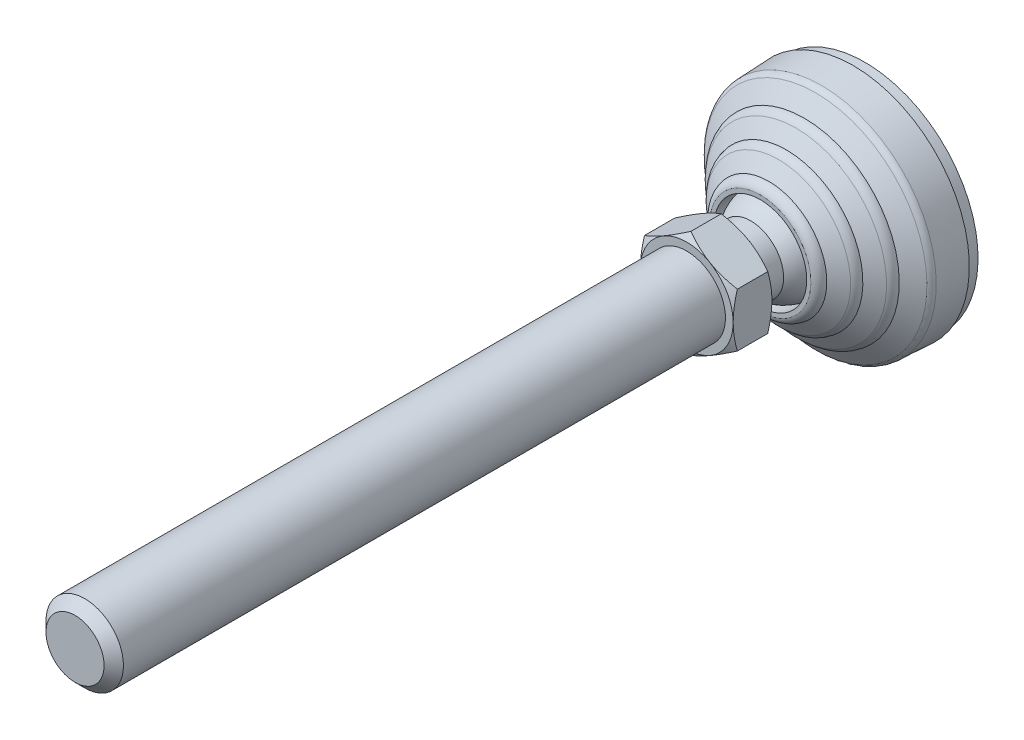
ISO-10303-21;
HEADER;
FILE_DESCRIPTION(('STEP AP214'),'2;1');
FILE_NAME('part.step','',(''),(''),'','','');
FILE_SCHEMA(('AUTOMOTIVE_DESIGN { 1 0 10303 214 1 1 1 1 }'));
ENDSEC;
DATA;
#1=APPLICATION_CONTEXT('core data for automotive mechanical design processes');
#2=APPLICATION_PROTOCOL_DEFINITION('international standard','automotive_design',2000,#1);
#3=PRODUCT_CONTEXT('',#1,'mechanical');
#4=PRODUCT('Part','Part','',(#3));
#5=PRODUCT_RELATED_PRODUCT_CATEGORY('part','',(#4));
#6=PRODUCT_DEFINITION_FORMATION('','',#4);
#7=PRODUCT_DEFINITION_CONTEXT('part definition',#1,'design');
#8=PRODUCT_DEFINITION('design','',#6,#7);
#9=PRODUCT_DEFINITION_SHAPE('','',#8);
#10=(LENGTH_UNIT() NAMED_UNIT(*) SI_UNIT(.MILLI.,.METRE.));
#11=(NAMED_UNIT(*) PLANE_ANGLE_UNIT() SI_UNIT($,.RADIAN.));
#12=(NAMED_UNIT(*) SI_UNIT($,.STERADIAN.) SOLID_ANGLE_UNIT());
#13=UNCERTAINTY_MEASURE_WITH_UNIT(LENGTH_MEASURE(1.E-05),#10,'distance_accuracy_value','');
#14=(GEOMETRIC_REPRESENTATION_CONTEXT(3) GLOBAL_UNCERTAINTY_ASSIGNED_CONTEXT((#13)) GLOBAL_UNIT_ASSIGNED_CONTEXT((#10,
#11,#12)) REPRESENTATION_CONTEXT('',''));
#15=CARTESIAN_POINT('',(0.,0.,0.));
#16=DIRECTION('',(0.,0.,1.));
#17=DIRECTION('',(1.,0.,0.));
#18=AXIS2_PLACEMENT_3D('',#15,#16,#17);
#19=CARTESIAN_POINT('',(0.,0.,93.4665));
#20=DIRECTION('',(0.,0.,-1.));
#21=DIRECTION('',(0.,1.,0.));
#22=AXIS2_PLACEMENT_3D('',#19,#20,#21);
#23=CYLINDRICAL_SURFACE('',#22,10.);
#24=CARTESIAN_POINT('',(0.,0.,201.5));
#25=DIRECTION('',(0.,0.,1.));
#26=DIRECTION('',(0.,-1.,0.));
#27=AXIS2_PLACEMENT_3D('',#24,#25,#26);
#28=CIRCLE('',#27,10.);
#29=CARTESIAN_POINT('',(0.,-10.,201.5));
#30=VERTEX_POINT('',#29);
#31=EDGE_CURVE('E9',#30,#30,#28,.F.);
#32=ORIENTED_EDGE('',*,*,#31,.T.);
#33=EDGE_LOOP('',(#32));
#34=FACE_BOUND('',#33,.T.);
#35=CARTESIAN_POINT('',(0.,0.,46.));
#36=DIRECTION('',(0.,0.,-1.));
#37=DIRECTION('',(0.,1.,0.));
#38=AXIS2_PLACEMENT_3D('',#35,#36,#37);
#39=CIRCLE('',#38,10.);
#40=CARTESIAN_POINT('',(0.,10.,46.));
#41=VERTEX_POINT('',#40);
#42=EDGE_CURVE('E124',#41,#41,#39,.F.);
#43=ORIENTED_EDGE('',*,*,#42,.T.);
#44=EDGE_LOOP('',(#43));
#45=FACE_BOUND('',#44,.T.);
#46=ADVANCED_FACE('F14',(#34,#45),#23,.T.);
#47=CARTESIAN_POINT('',(10.995,0.,46.));
#48=DIRECTION('',(0.,0.,1.));
#49=DIRECTION('',(0.,-1.,0.));
#50=AXIS2_PLACEMENT_3D('',#47,#48,#49);
#51=PLANE('',#50);
#52=CARTESIAN_POINT('',(0.,0.,46.));
#53=DIRECTION('',(0.,0.,-1.));
#54=DIRECTION('',(0.,1.,0.));
#55=AXIS2_PLACEMENT_3D('',#52,#53,#54);
#56=CIRCLE('',#55,11.99);
#57=CARTESIAN_POINT('',(0.,11.99,46.));
#58=VERTEX_POINT('',#57);
#59=EDGE_CURVE('E132',#58,#58,#56,.F.);
#60=ORIENTED_EDGE('',*,*,#59,.T.);
#61=EDGE_LOOP('',(#60));
#62=FACE_BOUND('',#61,.T.);
#63=ORIENTED_EDGE('',*,*,#42,.F.);
#64=EDGE_LOOP('',(#63));
#65=FACE_BOUND('',#64,.T.);
#66=ADVANCED_FACE('F157',(#62,#65),#51,.T.);
#67=CARTESIAN_POINT('',(0.,0.,44.9159643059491));
#68=DIRECTION('',(0.,0.,-1.));
#69=DIRECTION('',(0.,1.,0.));
#70=AXIS2_PLACEMENT_3D('',#67,#68,#69);
#71=CONICAL_SURFACE('',#70,13.8676048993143,1.0471975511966);
#72=ORIENTED_EDGE('',*,*,#59,.F.);
#73=EDGE_LOOP('',(#72));
#74=FACE_BOUND('',#73,.T.);
#75=CARTESIAN_POINT('',(-2.88482840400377E-08,-13.8564064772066,44.9224297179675));
#76=CARTESIAN_POINT('',(0.263784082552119,-13.7041106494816,45.010340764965));
#77=CARTESIAN_POINT('',(0.528551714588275,-13.5512469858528,45.0942615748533));
#78=CARTESIAN_POINT('',(1.06021019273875,-13.2442938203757,45.2530155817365));
#79=CARTESIAN_POINT('',(1.32710170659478,-13.0902039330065,45.3278457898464));
#80=CARTESIAN_POINT('',(2.13207647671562,-12.6254515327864,45.537252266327));
#81=CARTESIAN_POINT('',(2.67333741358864,-12.3129543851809,45.6563603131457));
#82=CARTESIAN_POINT('',(3.48330954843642,-11.8453167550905,45.796023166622));
#83=CARTESIAN_POINT('',(3.74960108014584,-11.6915732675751,45.8358073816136));
#84=CARTESIAN_POINT('',(4.28341699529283,-11.3833745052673,45.9025217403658));
#85=CARTESIAN_POINT('',(4.55094140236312,-11.2289192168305,45.9294516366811));
#86=CARTESIAN_POINT('',(5.08643614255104,-10.9197511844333,45.9697675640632));
#87=CARTESIAN_POINT('',(5.35440556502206,-10.7650389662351,45.9831696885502));
#88=CARTESIAN_POINT('',(5.8905925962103,-10.4554712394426,45.996144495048));
#89=CARTESIAN_POINT('',(6.15881019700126,-10.3006157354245,45.9957176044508));
#90=CARTESIAN_POINT('',(6.66023029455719,-10.0111207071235,45.9820002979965));
#91=CARTESIAN_POINT('',(6.89346857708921,-9.87646052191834,45.97038309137));
#92=CARTESIAN_POINT('',(7.35940867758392,-9.60744987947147,45.9369099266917));
#93=CARTESIAN_POINT('',(7.59211045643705,-9.47309944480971,45.9150532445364));
#94=CARTESIAN_POINT('',(8.05685109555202,-9.20478131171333,45.8614821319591));
#95=CARTESIAN_POINT('',(8.28888924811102,-9.07081402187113,45.8297595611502));
#96=CARTESIAN_POINT('',(8.75187776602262,-8.80350747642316,45.7570131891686));
#97=CARTESIAN_POINT('',(8.98282805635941,-8.67016826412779,45.7159887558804));
#98=CARTESIAN_POINT('',(9.68388987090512,-8.26541003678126,45.5779256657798));
#99=CARTESIAN_POINT('',(10.1519713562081,-7.99516306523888,45.4671213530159));
#100=CARTESIAN_POINT('',(11.081155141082,-7.45869855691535,45.2156417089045));
#101=CARTESIAN_POINT('',(11.5422693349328,-7.19247415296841,45.075025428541));
#102=CARTESIAN_POINT('',(11.9999999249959,-6.92820327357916,44.922429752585));
#103=B_SPLINE_CURVE_WITH_KNOTS('',3,(#75,#76,#77,#78,#79,#80,#81,#82,#83,#84,#85,#86,#87,#88,
#89,#90,#91,#92,#93,#94,#95,#96,#97,#98,#99,#100,#101,#102),.UNSPECIFIED.,.F.,.F.,(4,2,2,2,2,2,
2,2,2,2,2,2,2,4),(0.,0.950996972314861,1.90230578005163,3.80897261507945,4.73890631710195,
5.6688579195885,6.59770188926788,7.52651715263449,8.33503482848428,9.14360968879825,
9.95285348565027,10.7621522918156,12.4163368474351,14.0672749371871),.UNSPECIFIED.);
#104=CARTESIAN_POINT('',(-1.44241383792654E-08,-13.8564064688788,44.9224297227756));
#105=VERTEX_POINT('',#104);
#106=CARTESIAN_POINT('',(12.,-6.92820324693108,44.9224297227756));
#107=VERTEX_POINT('',#106);
#108=EDGE_CURVE('E143',#105,#107,#103,.T.);
#109=ORIENTED_EDGE('',*,*,#108,.T.);
#110=CARTESIAN_POINT('',(12.,-6.92820326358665,44.9224297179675));
#111=CARTESIAN_POINT('',(12.,-6.64374493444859,45.0045333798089));
#112=CARTESIAN_POINT('',(12.,-6.35829458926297,45.0831531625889));
#113=CARTESIAN_POINT('',(12.,-5.78524260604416,45.2325348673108));
#114=CARTESIAN_POINT('',(12.,-5.49764024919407,45.3032940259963));
#115=CARTESIAN_POINT('',(12.,-4.63053083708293,45.5026195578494));
#116=CARTESIAN_POINT('',(12.,-4.04782834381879,45.6179071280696));
#117=CARTESIAN_POINT('',(12.,-3.17548925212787,45.7575170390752));
#118=CARTESIAN_POINT('',(12.,-2.88840964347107,45.7982045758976));
#119=CARTESIAN_POINT('',(12.,-2.31290718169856,45.8685767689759));
#120=CARTESIAN_POINT('',(12.,-2.02448443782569,45.8982623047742));
#121=CARTESIAN_POINT('',(12.,-1.44696804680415,45.9459902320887));
#122=CARTESIAN_POINT('',(12.,-1.15787537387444,45.9640443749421));
#123=CARTESIAN_POINT('',(12.,-0.579188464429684,45.9881624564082));
#124=CARTESIAN_POINT('',(12.,-0.289594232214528,45.994226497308));
#125=CARTESIAN_POINT('',(12.,0.289594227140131,45.9942264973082));
#126=CARTESIAN_POINT('',(12.,0.579188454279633,45.9881624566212));
#127=CARTESIAN_POINT('',(12.,1.15787535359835,45.9640443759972));
#128=CARTESIAN_POINT('',(12.,1.44696802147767,45.9459902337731));
#129=CARTESIAN_POINT('',(12.,2.02448440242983,45.8982623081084));
#130=CARTESIAN_POINT('',(12.,2.31290714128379,45.8685767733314));
#131=CARTESIAN_POINT('',(12.,2.88840959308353,45.798204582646));
#132=CARTESIAN_POINT('',(12.,3.17548919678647,45.7575170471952));
#133=CARTESIAN_POINT('',(12.,4.04782827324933,45.6179071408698));
#134=CARTESIAN_POINT('',(12.,4.63053075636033,45.5026195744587));
#135=CARTESIAN_POINT('',(12.,5.49764015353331,45.3032940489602));
#136=CARTESIAN_POINT('',(12.,5.78524250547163,45.2325348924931));
#137=CARTESIAN_POINT('',(12.,6.35829447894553,45.0831531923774));
#138=CARTESIAN_POINT('',(12.,6.64374481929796,45.004533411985));
#139=CARTESIAN_POINT('',(12.,6.92820314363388,44.9224297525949));
#140=B_SPLINE_CURVE_WITH_KNOTS('',3,(#110,#111,#112,#113,#114,#115,#116,#117,#118,#119,#120,
#121,#122,#123,#124,#125,#126,#127,#128,#129,#130,#131,#132,#133,#134,#135,#136,#137,#138,#139),
.UNSPECIFIED.,.F.,.F.,(4,2,2,2,2,2,2,2,2,2,2,2,2,2,4),(0.,0.888148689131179,1.77660860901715,
3.55698615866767,4.42666281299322,5.2962699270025,6.16499708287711,7.03371682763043,
7.90243655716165,8.7711636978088,9.64077079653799,10.5104474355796,12.2908249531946,
13.1792848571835,14.0674335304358),.UNSPECIFIED.);
#141=CARTESIAN_POINT('',(12.0000000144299,6.92820322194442,44.9224297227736));
#142=VERTEX_POINT('',#141);
#143=EDGE_CURVE('E135',#107,#142,#140,.T.);
#144=ORIENTED_EDGE('',*,*,#143,.T.);
#145=CARTESIAN_POINT('',(12.0000000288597,6.92820321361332,44.9224297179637));
#146=CARTESIAN_POINT('',(11.7362159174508,7.08049904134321,45.0103407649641));
#147=CARTESIAN_POINT('',(11.4714482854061,7.23336270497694,45.0942615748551));
#148=CARTESIAN_POINT('',(10.9397898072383,7.54031587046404,45.2530155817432));
#149=CARTESIAN_POINT('',(10.6728982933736,7.69440575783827,45.3278457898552));
#150=CARTESIAN_POINT('',(9.86792352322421,8.15915815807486,45.5372522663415));
#151=CARTESIAN_POINT('',(9.32666258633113,8.47165530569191,45.6563603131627));
#152=CARTESIAN_POINT('',(8.51669045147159,8.93929293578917,45.7960231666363));
#153=CARTESIAN_POINT('',(8.25039891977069,9.0930364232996,45.8358073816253));
#154=CARTESIAN_POINT('',(7.71658300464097,9.40123518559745,45.9025217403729));
#155=CARTESIAN_POINT('',(7.44905859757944,9.55569047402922,45.9294516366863));
#156=CARTESIAN_POINT('',(6.91356385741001,9.86485850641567,45.9697675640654));
#157=CARTESIAN_POINT('',(6.64559443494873,10.0195707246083,45.9831696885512));
#158=CARTESIAN_POINT('',(6.10940740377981,10.3291384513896,45.996144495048));
#159=CARTESIAN_POINT('',(5.84118980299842,10.4839939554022,45.9957176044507));
#160=CARTESIAN_POINT('',(5.33976970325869,10.773488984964,45.9820002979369));
#161=CARTESIAN_POINT('',(5.10653141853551,10.9081491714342,45.970383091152));
#162=CARTESIAN_POINT('',(4.64059131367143,11.1771598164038,45.9369099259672));
#163=CARTESIAN_POINT('',(4.4078895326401,11.3115102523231,45.9150532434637));
#164=CARTESIAN_POINT('',(3.94314888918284,11.5798283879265,45.8614821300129));
#165=CARTESIAN_POINT('',(3.71111073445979,11.7137956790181,45.8297595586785));
#166=CARTESIAN_POINT('',(3.24812221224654,11.9811022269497,45.7570131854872));
#167=CARTESIAN_POINT('',(3.01717191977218,12.1144414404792,45.7159887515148));
#168=CARTESIAN_POINT('',(2.31611009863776,12.5191996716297,45.5779256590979));
#169=CARTESIAN_POINT('',(1.84802860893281,12.7894466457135,45.4671213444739));
#170=CARTESIAN_POINT('',(0.918844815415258,13.3259111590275,45.2156416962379));
#171=CARTESIAN_POINT('',(0.457730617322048,13.5921355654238,45.0750254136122));
#172=CARTESIAN_POINT('',(2.30778996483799E-08,13.856406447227,44.9224297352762));
#173=B_SPLINE_CURVE_WITH_KNOTS('',3,(#145,#146,#147,#148,#149,#150,#151,#152,#153,#154,#155,
#156,#157,#158,#159,#160,#161,#162,#163,#164,#165,#166,#167,#168,#169,#170,#171,#172),
.UNSPECIFIED.,.F.,.F.,(4,2,2,2,2,2,2,2,2,2,2,2,2,4),(0.,0.95099697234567,1.9023057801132,
3.8089726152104,4.73890631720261,5.66885791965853,6.59770188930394,7.52651715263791,
8.33503483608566,9.14360970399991,9.95285350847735,10.7621523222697,12.4163368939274,
14.0672749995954),.UNSPECIFIED.);
#174=CARTESIAN_POINT('',(-1.15389591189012E-08,13.856406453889,44.92242973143));
#175=VERTEX_POINT('',#174);
#176=EDGE_CURVE('E180',#142,#175,#173,.T.);
#177=ORIENTED_EDGE('',*,*,#176,.T.);
#178=CARTESIAN_POINT('',(-2.30779115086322E-08,13.856406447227,44.9224297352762));
#179=CARTESIAN_POINT('',(-0.263784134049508,13.7041106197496,45.0103407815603));
#180=CARTESIAN_POINT('',(-0.528551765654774,13.5512469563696,45.0942615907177));
#181=CARTESIAN_POINT('',(-1.06021024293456,13.2442937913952,45.2530155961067));
#182=CARTESIAN_POINT('',(-1.32710175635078,13.0902039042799,45.3278458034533));
#183=CARTESIAN_POINT('',(-2.13207652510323,12.6254515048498,45.5372522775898));
#184=CARTESIAN_POINT('',(-2.67333746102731,12.3129543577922,45.656360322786));
#185=CARTESIAN_POINT('',(-3.48330959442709,11.8453167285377,45.7960231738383));
#186=CARTESIAN_POINT('',(-3.74960112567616,11.6915732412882,45.8358073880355));
#187=CARTESIAN_POINT('',(-4.28341703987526,11.3833744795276,45.9025217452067));
#188=CARTESIAN_POINT('',(-4.55094144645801,11.2289191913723,45.9294516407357));
#189=CARTESIAN_POINT('',(-5.08643618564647,10.9197511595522,45.9697675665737));
#190=CARTESIAN_POINT('',(-5.35440560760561,10.7650389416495,45.9831696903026));
#191=CARTESIAN_POINT('',(-5.89059263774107,10.4554712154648,45.9961444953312));
#192=CARTESIAN_POINT('',(-6.15881023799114,10.300615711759,45.9957176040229));
#193=CARTESIAN_POINT('',(-6.66023033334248,10.0111206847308,45.9820002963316));
#194=CARTESIAN_POINT('',(-6.89346861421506,9.87646050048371,45.9703830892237));
#195=CARTESIAN_POINT('',(-7.35940871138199,9.60744985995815,45.9369099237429));
#196=CARTESIAN_POINT('',(-7.59211048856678,9.47309942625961,45.9150532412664));
#197=CARTESIAN_POINT('',(-8.05685112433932,9.20478129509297,45.8614821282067));
#198=CARTESIAN_POINT('',(-8.28888927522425,9.0708140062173,45.8297595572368));
#199=CARTESIAN_POINT('',(-8.75187778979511,8.80350746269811,45.7570131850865));
#200=CARTESIAN_POINT('',(-8.98282807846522,8.67016825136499,45.7159887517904));
#201=CARTESIAN_POINT('',(-9.68388988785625,8.26541002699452,45.5779256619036));
#202=CARTESIAN_POINT('',(-10.1519713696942,7.9951630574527,45.4671213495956));
#203=CARTESIAN_POINT('',(-11.0811551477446,7.45869855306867,45.2156417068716));
#204=CARTESIAN_POINT('',(-11.5422693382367,7.19247415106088,45.0750254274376));
#205=CARTESIAN_POINT('',(-11.9999999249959,6.92820327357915,44.922429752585));
#206=B_SPLINE_CURVE_WITH_KNOTS('',3,(#178,#179,#180,#181,#182,#183,#184,#185,#186,#187,#188,
#189,#190,#191,#192,#193,#194,#195,#196,#197,#198,#199,#200,#201,#202,#203,#204,#205),
.UNSPECIFIED.,.F.,.F.,(4,2,2,2,2,2,2,2,2,2,2,2,2,4),(0.,0.9509969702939,1.90230577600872,
3.80897260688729,4.73890630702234,5.6688579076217,6.5977018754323,7.52651713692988,
8.33503480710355,9.14360966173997,9.95285345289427,10.7621522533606,12.4163367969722,
14.0672748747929),.UNSPECIFIED.);
#207=CARTESIAN_POINT('',(-12.,6.92820324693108,44.9224297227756));
#208=VERTEX_POINT('',#207);
#209=EDGE_CURVE('E172',#175,#208,#206,.T.);
#210=ORIENTED_EDGE('',*,*,#209,.T.);
#211=CARTESIAN_POINT('',(-12.,6.92820326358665,44.9224297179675));
#212=CARTESIAN_POINT('',(-12.,6.64374493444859,45.0045333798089));
#213=CARTESIAN_POINT('',(-12.,6.35829458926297,45.0831531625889));
#214=CARTESIAN_POINT('',(-12.,5.78524260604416,45.2325348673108));
#215=CARTESIAN_POINT('',(-12.,5.49764024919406,45.3032940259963));
#216=CARTESIAN_POINT('',(-12.,4.63053083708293,45.5026195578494));
#217=CARTESIAN_POINT('',(-12.,4.04782834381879,45.6179071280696));
#218=CARTESIAN_POINT('',(-12.,3.17548925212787,45.7575170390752));
#219=CARTESIAN_POINT('',(-12.,2.88840964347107,45.7982045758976));
#220=CARTESIAN_POINT('',(-12.,2.31290718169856,45.8685767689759));
#221=CARTESIAN_POINT('',(-12.,2.02448443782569,45.8982623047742));
#222=CARTESIAN_POINT('',(-12.,1.44696804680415,45.9459902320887));
#223=CARTESIAN_POINT('',(-12.,1.15787537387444,45.9640443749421));
#224=CARTESIAN_POINT('',(-12.,0.579188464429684,45.9881624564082));
#225=CARTESIAN_POINT('',(-12.,0.289594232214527,45.994226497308));
#226=CARTESIAN_POINT('',(-12.,-0.289594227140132,45.9942264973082));
#227=CARTESIAN_POINT('',(-12.,-0.579188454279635,45.9881624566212));
#228=CARTESIAN_POINT('',(-12.,-1.15787535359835,45.9640443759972));
#229=CARTESIAN_POINT('',(-12.,-1.44696802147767,45.9459902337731));
#230=CARTESIAN_POINT('',(-12.,-2.02448440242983,45.8982623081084));
#231=CARTESIAN_POINT('',(-12.,-2.31290714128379,45.8685767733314));
#232=CARTESIAN_POINT('',(-12.,-2.88840959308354,45.798204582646));
#233=CARTESIAN_POINT('',(-12.,-3.17548919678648,45.7575170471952));
#234=CARTESIAN_POINT('',(-12.,-4.04782827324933,45.6179071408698));
#235=CARTESIAN_POINT('',(-12.,-4.63053075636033,45.5026195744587));
#236=CARTESIAN_POINT('',(-12.,-5.49764015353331,45.3032940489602));
#237=CARTESIAN_POINT('',(-12.,-5.78524250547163,45.2325348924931));
#238=CARTESIAN_POINT('',(-12.,-6.35829447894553,45.0831531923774));
#239=CARTESIAN_POINT('',(-12.,-6.64374481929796,45.004533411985));
#240=CARTESIAN_POINT('',(-12.,-6.92820314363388,44.9224297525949));
#241=B_SPLINE_CURVE_WITH_KNOTS('',3,(#211,#212,#213,#214,#215,#216,#217,#218,#219,#220,#221,
#222,#223,#224,#225,#226,#227,#228,#229,#230,#231,#232,#233,#234,#235,#236,#237,#238,#239,#240),
.UNSPECIFIED.,.F.,.F.,(4,2,2,2,2,2,2,2,2,2,2,2,2,2,4),(0.,0.888148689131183,1.77660860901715,
3.55698615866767,4.42666281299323,5.2962699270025,6.16499708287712,7.03371682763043,
7.90243655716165,8.7711636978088,9.640770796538,10.5104474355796,12.2908249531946,
13.1792848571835,14.0674335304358),.UNSPECIFIED.);
#242=CARTESIAN_POINT('',(-12.0000000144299,-6.92820322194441,44.9224297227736));
#243=VERTEX_POINT('',#242);
#244=EDGE_CURVE('E350',#208,#243,#241,.T.);
#245=ORIENTED_EDGE('',*,*,#244,.T.);
#246=CARTESIAN_POINT('',(-12.0000000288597,-6.92820321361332,44.9224297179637));
#247=CARTESIAN_POINT('',(-11.7362159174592,-7.08049904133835,45.0103407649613));
#248=CARTESIAN_POINT('',(-11.471448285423,-7.23336270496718,45.0942615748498));
#249=CARTESIAN_POINT('',(-10.9397898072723,-7.54031587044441,45.2530155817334));
#250=CARTESIAN_POINT('',(-10.6728982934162,-7.69440575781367,45.3278457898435));
#251=CARTESIAN_POINT('',(-9.86792352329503,-8.15915815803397,45.5372522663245));
#252=CARTESIAN_POINT('',(-9.3266625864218,-8.47165530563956,45.6563603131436));
#253=CARTESIAN_POINT('',(-8.5166904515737,-8.93929293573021,45.7960231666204));
#254=CARTESIAN_POINT('',(-8.25039891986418,-9.09303642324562,45.8358073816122));
#255=CARTESIAN_POINT('',(-7.71658300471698,-9.40123518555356,45.9025217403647));
#256=CARTESIAN_POINT('',(-7.44905859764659,-9.55569047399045,45.9294516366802));
#257=CARTESIAN_POINT('',(-6.91356385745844,-9.8648585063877,45.9697675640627));
#258=CARTESIAN_POINT('',(-6.64559443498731,-10.019570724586,45.9831696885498));
#259=CARTESIAN_POINT('',(-6.10940740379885,-10.3291384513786,45.996144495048));
#260=CARTESIAN_POINT('',(-5.84118980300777,-10.4839939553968,45.9957176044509));
#261=CARTESIAN_POINT('',(-5.33976970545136,-10.7734889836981,45.9820002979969));
#262=CARTESIAN_POINT('',(-5.10653142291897,-10.9081491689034,45.9703830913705));
#263=CARTESIAN_POINT('',(-4.64059132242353,-11.1771598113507,45.9369099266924));
#264=CARTESIAN_POINT('',(-4.40788954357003,-11.3115102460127,45.9150532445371));
#265=CARTESIAN_POINT('',(-3.94314890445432,-11.5798283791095,45.8614821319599));
#266=CARTESIAN_POINT('',(-3.71111075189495,-11.7137956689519,45.8297595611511));
#267=CARTESIAN_POINT('',(-3.24812223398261,-11.9811022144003,45.7570131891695));
#268=CARTESIAN_POINT('',(-3.01717194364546,-12.1144414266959,45.7159887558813));
#269=CARTESIAN_POINT('',(-2.3161101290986,-12.5191996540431,45.5779256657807));
#270=CARTESIAN_POINT('',(-1.84802864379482,-12.7894466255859,45.4671213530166));
#271=CARTESIAN_POINT('',(-0.918844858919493,-13.3259111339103,45.215641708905));
#272=CARTESIAN_POINT('',(-0.457730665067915,-13.5921355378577,45.0750254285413));
#273=CARTESIAN_POINT('',(-7.50040961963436E-08,-13.8564064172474,44.922429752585));
#274=B_SPLINE_CURVE_WITH_KNOTS('',3,(#246,#247,#248,#249,#250,#251,#252,#253,#254,#255,#256,
#257,#258,#259,#260,#261,#262,#263,#264,#265,#266,#267,#268,#269,#270,#271,#272,#273),
.UNSPECIFIED.,.F.,.F.,(4,2,2,2,2,2,2,2,2,2,2,2,2,4),(0.,0.950996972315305,1.90230578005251,
3.80897261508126,4.73890631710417,5.66885791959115,6.59770188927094,7.52651715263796,
8.33503482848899,9.14360968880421,9.95285348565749,10.7621522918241,12.4163368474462,
14.0672749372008),.UNSPECIFIED.);
#275=EDGE_CURVE('E162',#243,#105,#274,.T.);
#276=ORIENTED_EDGE('',*,*,#275,.T.);
#277=EDGE_LOOP('',(#109,#144,#177,#210,#245,#276));
#278=FACE_BOUND('',#277,.T.);
#279=ADVANCED_FACE('F152',(#74,#278),#71,.T.);
#280=CARTESIAN_POINT('',(0.,-13.856406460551,46.1));
#281=DIRECTION('',(0.5,0.866025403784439,0.));
#282=DIRECTION('',(-0.866025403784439,0.5,0.));
#283=AXIS2_PLACEMENT_3D('',#280,#281,#282);
#284=PLANE('',#283);
#285=DIRECTION('',(0.,0.,1.));
#286=VECTOR('',#285,1.);
#287=CARTESIAN_POINT('',(0.,-13.856406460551,46.1));
#288=LINE('',#287,#286);
#289=CARTESIAN_POINT('',(0.,-13.856406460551,37.0775702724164));
#290=VERTEX_POINT('',#289);
#291=EDGE_CURVE('E376',#290,#105,#288,.T.);
#292=ORIENTED_EDGE('',*,*,#291,.T.);
#293=ORIENTED_EDGE('',*,*,#275,.F.);
#294=DIRECTION('',(0.,0.,1.));
#295=VECTOR('',#294,1.);
#296=CARTESIAN_POINT('',(-12.,-6.9282032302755,46.1));
#297=LINE('',#296,#295);
#298=CARTESIAN_POINT('',(-12.,-6.9282032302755,37.0775702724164));
#299=VERTEX_POINT('',#298);
#300=EDGE_CURVE('E368',#299,#243,#297,.T.);
#301=ORIENTED_EDGE('',*,*,#300,.F.);
#302=CARTESIAN_POINT('',(0.,-13.856406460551,37.0775702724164));
#303=CARTESIAN_POINT('',(-0.263784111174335,-13.7041106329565,36.9896592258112));
#304=CARTESIAN_POINT('',(-0.528551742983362,-13.5512469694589,36.9057384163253));
#305=CARTESIAN_POINT('',(-1.0602102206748,-13.2442938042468,36.7469844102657));
#306=CARTESIAN_POINT('',(-1.32710173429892,-13.0902039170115,36.6721542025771));
#307=CARTESIAN_POINT('',(-2.13207650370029,-12.6254515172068,36.4627477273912));
#308=CARTESIAN_POINT('',(-2.67333744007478,-12.3129543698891,36.3436396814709));
#309=CARTESIAN_POINT('',(-3.48330957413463,-11.8453167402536,36.2039768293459));
#310=CARTESIAN_POINT('',(-3.74960110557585,-11.6915732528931,36.1641926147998));
#311=CARTESIAN_POINT('',(-4.28341702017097,-11.3833744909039,36.097478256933));
#312=CARTESIAN_POINT('',(-4.55094142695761,-11.2289192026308,36.0705483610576));
#313=CARTESIAN_POINT('',(-5.08643616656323,-10.9197511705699,36.0302324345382));
#314=CARTESIAN_POINT('',(-5.35440558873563,-10.765038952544,36.0168303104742));
#315=CARTESIAN_POINT('',(-5.89059261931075,-10.4554712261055,36.0038555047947));
#316=CARTESIAN_POINT('',(-6.15881021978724,-10.300615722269,36.0042823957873));
#317=CARTESIAN_POINT('',(-6.66023031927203,-10.0111206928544,36.0179997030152));
#318=CARTESIAN_POINT('',(-6.8934686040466,-9.87646050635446,36.029616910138));
#319=CARTESIAN_POINT('',(-7.35940870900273,-9.6074498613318,36.063090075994));
#320=CARTESIAN_POINT('',(-7.59211049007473,-9.47309942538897,36.0849467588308));
#321=CARTESIAN_POINT('',(-8.05685113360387,-9.20478128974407,36.1385178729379));
#322=CARTESIAN_POINT('',(-8.28888928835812,-9.07081399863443,36.1702404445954));
#323=CARTESIAN_POINT('',(-8.75187781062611,-8.8035074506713,36.2429868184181));
#324=CARTESIAN_POINT('',(-8.98282810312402,-8.67016823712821,36.2840112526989));
#325=CARTESIAN_POINT('',(-9.6838899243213,-8.2654100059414,36.4220743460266));
#326=CARTESIAN_POINT('',(-10.1519714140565,-7.99516303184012,36.5328786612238));
#327=CARTESIAN_POINT('',(-11.0811552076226,-7.45869851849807,36.7843583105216));
#328=CARTESIAN_POINT('',(-11.5422694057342,-7.19247411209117,36.924974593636));
#329=CARTESIAN_POINT('',(-12.,-6.9282032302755,37.0775702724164));
#330=B_SPLINE_CURVE_WITH_KNOTS('',3,(#302,#303,#304,#305,#306,#307,#308,#309,#310,#311,#312,
#313,#314,#315,#316,#317,#318,#319,#320,#321,#322,#323,#324,#325,#326,#327,#328,#329),
.UNSPECIFIED.,.F.,.F.,(4,2,2,2,2,2,2,2,2,2,2,2,2,4),(0.,0.950996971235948,1.90230577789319,
3.80897261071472,4.73890631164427,5.66885791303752,6.59770188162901,7.52651714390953,
8.33503482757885,9.14360969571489,9.9528535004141,10.7621523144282,12.4163368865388,
14.0672749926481),.UNSPECIFIED.);
#331=EDGE_CURVE('E370',#290,#299,#330,.T.);
#332=ORIENTED_EDGE('',*,*,#331,.F.);
#333=EDGE_LOOP('',(#292,#293,#301,#332));
#334=FACE_BOUND('',#333,.T.);
#335=ADVANCED_FACE('F156',(#334),#284,.F.);
#336=CARTESIAN_POINT('',(12.,-6.92820323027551,46.1));
#337=DIRECTION('',(-0.5,0.866025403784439,0.));
#338=DIRECTION('',(-0.866025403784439,-0.5,0.));
#339=AXIS2_PLACEMENT_3D('',#336,#337,#338);
#340=PLANE('',#339);
#341=DIRECTION('',(0.,0.,1.));
#342=VECTOR('',#341,1.);
#343=CARTESIAN_POINT('',(12.,-6.92820323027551,46.1));
#344=LINE('',#343,#342);
#345=CARTESIAN_POINT('',(12.,-6.92820323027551,37.0775702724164));
#346=VERTEX_POINT('',#345);
#347=EDGE_CURVE('E31',#346,#107,#344,.T.);
#348=ORIENTED_EDGE('',*,*,#347,.T.);
#349=ORIENTED_EDGE('',*,*,#108,.F.);
#350=ORIENTED_EDGE('',*,*,#291,.F.);
#351=CARTESIAN_POINT('',(12.,-6.92820323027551,37.0775702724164));
#352=CARTESIAN_POINT('',(11.7362158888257,-7.08049905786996,36.9896592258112));
#353=CARTESIAN_POINT('',(11.4714482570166,-7.2333627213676,36.9057384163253));
#354=CARTESIAN_POINT('',(10.9397897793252,-7.5403158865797,36.7469844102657));
#355=CARTESIAN_POINT('',(10.6728982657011,-7.69440577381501,36.6721542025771));
#356=CARTESIAN_POINT('',(9.86792349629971,-8.15915817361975,36.4627477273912));
#357=CARTESIAN_POINT('',(9.32666255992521,-8.4716553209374,36.3436396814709));
#358=CARTESIAN_POINT('',(8.51669042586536,-8.93929295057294,36.2039768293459));
#359=CARTESIAN_POINT('',(8.25039889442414,-9.09303643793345,36.1641926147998));
#360=CARTESIAN_POINT('',(7.71658297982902,-9.40123519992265,36.097478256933));
#361=CARTESIAN_POINT('',(7.44905857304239,-9.55569048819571,36.0705483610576));
#362=CARTESIAN_POINT('',(6.91356383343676,-9.86485852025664,36.0302324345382));
#363=CARTESIAN_POINT('',(6.64559441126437,-10.0195707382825,36.0168303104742));
#364=CARTESIAN_POINT('',(6.10940738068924,-10.329138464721,36.0038555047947));
#365=CARTESIAN_POINT('',(5.84118978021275,-10.4839939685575,36.0042823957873));
#366=CARTESIAN_POINT('',(5.33976968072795,-10.7734889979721,36.0179997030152));
#367=CARTESIAN_POINT('',(5.10653139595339,-10.9081491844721,36.029616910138));
#368=CARTESIAN_POINT('',(4.64059129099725,-11.1771598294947,36.063090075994));
#369=CARTESIAN_POINT('',(4.40788950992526,-11.3115102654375,36.0849467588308));
#370=CARTESIAN_POINT('',(3.94314886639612,-11.5798284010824,36.1385178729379));
#371=CARTESIAN_POINT('',(3.71111071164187,-11.7137956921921,36.1702404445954));
#372=CARTESIAN_POINT('',(3.24812218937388,-11.9811022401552,36.2429868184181));
#373=CARTESIAN_POINT('',(3.01717189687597,-12.1144414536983,36.2840112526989));
#374=CARTESIAN_POINT('',(2.3161100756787,-12.5191996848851,36.4220743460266));
#375=CARTESIAN_POINT('',(1.84802858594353,-12.7894466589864,36.5328786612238));
#376=CARTESIAN_POINT('',(0.918844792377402,-13.3259111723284,36.7843583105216));
#377=CARTESIAN_POINT('',(0.457730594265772,-13.5921355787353,36.924974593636));
#378=CARTESIAN_POINT('',(0.,-13.856406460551,37.0775702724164));
#379=B_SPLINE_CURVE_WITH_KNOTS('',3,(#351,#352,#353,#354,#355,#356,#357,#358,#359,#360,#361,
#362,#363,#364,#365,#366,#367,#368,#369,#370,#371,#372,#373,#374,#375,#376,#377,#378),
.UNSPECIFIED.,.F.,.F.,(4,2,2,2,2,2,2,2,2,2,2,2,2,4),(0.,0.95099697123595,1.90230577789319,
3.80897261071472,4.73890631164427,5.66885791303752,6.59770188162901,7.52651714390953,
8.33503482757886,9.14360969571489,9.9528535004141,10.7621523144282,12.4163368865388,
14.0672749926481),.UNSPECIFIED.);
#380=EDGE_CURVE('E377',#346,#290,#379,.T.);
#381=ORIENTED_EDGE('',*,*,#380,.F.);
#382=EDGE_LOOP('',(#348,#349,#350,#381));
#383=FACE_BOUND('',#382,.T.);
#384=ADVANCED_FACE('F383',(#383),#340,.F.);
#385=CARTESIAN_POINT('',(-12.,6.92820323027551,46.1));
#386=DIRECTION('',(0.5,-0.866025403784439,0.));
#387=DIRECTION('',(0.866025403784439,0.5,0.));
#388=AXIS2_PLACEMENT_3D('',#385,#386,#387);
#389=PLANE('',#388);
#390=DIRECTION('',(0.,0.,1.));
#391=VECTOR('',#390,1.);
#392=CARTESIAN_POINT('',(-12.,6.92820323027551,46.1));
#393=LINE('',#392,#391);
#394=CARTESIAN_POINT('',(-12.,6.92820323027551,37.0775702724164));
#395=VERTEX_POINT('',#394);
#396=EDGE_CURVE('E369',#395,#208,#393,.T.);
#397=ORIENTED_EDGE('',*,*,#396,.T.);
#398=ORIENTED_EDGE('',*,*,#209,.F.);
#399=DIRECTION('',(0.,0.,1.));
#400=VECTOR('',#399,1.);
#401=CARTESIAN_POINT('',(0.,13.856406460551,46.1));
#402=LINE('',#401,#400);
#403=CARTESIAN_POINT('',(0.,13.856406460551,37.0775702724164));
#404=VERTEX_POINT('',#403);
#405=EDGE_CURVE('E211',#404,#175,#402,.T.);
#406=ORIENTED_EDGE('',*,*,#405,.F.);
#407=CARTESIAN_POINT('',(-12.,6.92820323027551,37.0775702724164));
#408=CARTESIAN_POINT('',(-11.7362158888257,7.08049905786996,36.9896592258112));
#409=CARTESIAN_POINT('',(-11.4714482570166,7.2333627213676,36.9057384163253));
#410=CARTESIAN_POINT('',(-10.9397897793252,7.5403158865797,36.7469844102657));
#411=CARTESIAN_POINT('',(-10.6728982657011,7.69440577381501,36.6721542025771));
#412=CARTESIAN_POINT('',(-9.86792349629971,8.15915817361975,36.4627477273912));
#413=CARTESIAN_POINT('',(-9.32666255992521,8.4716553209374,36.3436396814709));
#414=CARTESIAN_POINT('',(-8.51669042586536,8.93929295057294,36.2039768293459));
#415=CARTESIAN_POINT('',(-8.25039889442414,9.09303643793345,36.1641926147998));
#416=CARTESIAN_POINT('',(-7.71658297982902,9.40123519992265,36.097478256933));
#417=CARTESIAN_POINT('',(-7.44905857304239,9.55569048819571,36.0705483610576));
#418=CARTESIAN_POINT('',(-6.91356383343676,9.86485852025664,36.0302324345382));
#419=CARTESIAN_POINT('',(-6.64559441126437,10.0195707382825,36.0168303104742));
#420=CARTESIAN_POINT('',(-6.10940738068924,10.329138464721,36.0038555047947));
#421=CARTESIAN_POINT('',(-5.84118978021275,10.4839939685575,36.0042823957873));
#422=CARTESIAN_POINT('',(-5.33976968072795,10.7734889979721,36.0179997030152));
#423=CARTESIAN_POINT('',(-5.10653139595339,10.9081491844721,36.029616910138));
#424=CARTESIAN_POINT('',(-4.64059129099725,11.1771598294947,36.063090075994));
#425=CARTESIAN_POINT('',(-4.40788950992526,11.3115102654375,36.0849467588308));
#426=CARTESIAN_POINT('',(-3.94314886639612,11.5798284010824,36.1385178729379));
#427=CARTESIAN_POINT('',(-3.71111071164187,11.7137956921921,36.1702404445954));
#428=CARTESIAN_POINT('',(-3.24812218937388,11.9811022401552,36.2429868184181));
#429=CARTESIAN_POINT('',(-3.01717189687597,12.1144414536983,36.2840112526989));
#430=CARTESIAN_POINT('',(-2.3161100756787,12.5191996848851,36.4220743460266));
#431=CARTESIAN_POINT('',(-1.84802858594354,12.7894466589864,36.5328786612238));
#432=CARTESIAN_POINT('',(-0.918844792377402,13.3259111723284,36.7843583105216));
#433=CARTESIAN_POINT('',(-0.457730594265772,13.5921355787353,36.924974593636));
#434=CARTESIAN_POINT('',(0.,13.856406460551,37.0775702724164));
#435=B_SPLINE_CURVE_WITH_KNOTS('',3,(#407,#408,#409,#410,#411,#412,#413,#414,#415,#416,#417,
#418,#419,#420,#421,#422,#423,#424,#425,#426,#427,#428,#429,#430,#431,#432,#433,#434),
.UNSPECIFIED.,.F.,.F.,(4,2,2,2,2,2,2,2,2,2,2,2,2,4),(0.,0.95099697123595,1.90230577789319,
3.80897261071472,4.73890631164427,5.66885791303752,6.59770188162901,7.52651714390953,
8.33503482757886,9.14360969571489,9.9528535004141,10.7621523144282,12.4163368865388,
14.0672749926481),.UNSPECIFIED.);
#436=EDGE_CURVE('E213',#395,#404,#435,.T.);
#437=ORIENTED_EDGE('',*,*,#436,.F.);
#438=EDGE_LOOP('',(#397,#398,#406,#437));
#439=FACE_BOUND('',#438,.T.);
#440=ADVANCED_FACE('F199',(#439),#389,.F.);
#441=CARTESIAN_POINT('',(-12.,-6.92820323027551,46.1));
#442=DIRECTION('',(1.,0.,0.));
#443=DIRECTION('',(0.,1.,0.));
#444=AXIS2_PLACEMENT_3D('',#441,#442,#443);
#445=PLANE('',#444);
#446=ORIENTED_EDGE('',*,*,#300,.T.);
#447=ORIENTED_EDGE('',*,*,#244,.F.);
#448=ORIENTED_EDGE('',*,*,#396,.F.);
#449=CARTESIAN_POINT('',(-12.,-6.9282032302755,37.0775702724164));
#450=CARTESIAN_POINT('',(-12.,-6.64374490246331,36.9954666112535));
#451=CARTESIAN_POINT('',(-12.,-6.35829455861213,36.9168468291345));
#452=CARTESIAN_POINT('',(-12.,-5.78524257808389,36.7674651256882));
#453=CARTESIAN_POINT('',(-12.,-5.49764022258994,36.6967059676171));
#454=CARTESIAN_POINT('',(-12.,-4.63053081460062,36.4973804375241));
#455=CARTESIAN_POINT('',(-12.,-4.04782832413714,36.3820928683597));
#456=CARTESIAN_POINT('',(-12.,-3.17548923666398,36.2424829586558));
#457=CARTESIAN_POINT('',(-12.,-2.88840962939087,36.2017954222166));
#458=CARTESIAN_POINT('',(-12.,-2.31290717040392,36.1314232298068));
#459=CARTESIAN_POINT('',(-12.,-2.02448442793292,36.1017376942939));
#460=CARTESIAN_POINT('',(-12.,-1.44696803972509,36.0540097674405));
#461=CARTESIAN_POINT('',(-12.,-1.1578753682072,36.035955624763));
#462=CARTESIAN_POINT('',(-12.,-0.579188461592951,36.0118375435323));
#463=CARTESIAN_POINT('',(-12.,-0.289594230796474,36.0057735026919));
#464=CARTESIAN_POINT('',(-12.,0.28959423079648,36.0057735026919));
#465=CARTESIAN_POINT('',(-12.,0.579188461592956,36.0118375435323));
#466=CARTESIAN_POINT('',(-12.,1.15787536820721,36.035955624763));
#467=CARTESIAN_POINT('',(-12.,1.4469680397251,36.0540097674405));
#468=CARTESIAN_POINT('',(-12.,2.02448442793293,36.1017376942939));
#469=CARTESIAN_POINT('',(-12.,2.31290717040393,36.1314232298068));
#470=CARTESIAN_POINT('',(-12.,2.88840962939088,36.2017954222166));
#471=CARTESIAN_POINT('',(-12.,3.17548923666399,36.2424829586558));
#472=CARTESIAN_POINT('',(-12.,4.04782832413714,36.3820928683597));
#473=CARTESIAN_POINT('',(-12.,4.63053081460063,36.4973804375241));
#474=CARTESIAN_POINT('',(-12.,5.49764022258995,36.6967059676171));
#475=CARTESIAN_POINT('',(-12.,5.7852425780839,36.7674651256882));
#476=CARTESIAN_POINT('',(-12.,6.35829455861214,36.9168468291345));
#477=CARTESIAN_POINT('',(-12.,6.64374490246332,36.9954666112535));
#478=CARTESIAN_POINT('',(-12.,6.92820323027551,37.0775702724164));
#479=B_SPLINE_CURVE_WITH_KNOTS('',3,(#449,#450,#451,#452,#453,#454,#455,#456,#457,#458,#459,
#460,#461,#462,#463,#464,#465,#466,#467,#468,#469,#470,#471,#472,#473,#474,#475,#476,#477,#478),
.UNSPECIFIED.,.F.,.F.,(4,2,2,2,2,2,2,2,2,2,2,2,2,2,4),(0.,0.888148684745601,1.77660860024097,
3.55698614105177,4.42666279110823,5.29626990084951,6.16499705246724,7.03371679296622,
7.90243653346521,8.77116368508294,9.64077079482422,10.5104474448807,12.2908249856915,
13.1792849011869,14.0674335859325),.UNSPECIFIED.);
#480=EDGE_CURVE('E362',#299,#395,#479,.T.);
#481=ORIENTED_EDGE('',*,*,#480,.F.);
#482=EDGE_LOOP('',(#446,#447,#448,#481));
#483=FACE_BOUND('',#482,.T.);
#484=ADVANCED_FACE('F356',(#483),#445,.F.);
#485=CARTESIAN_POINT('',(12.,6.92820323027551,46.1));
#486=DIRECTION('',(-1.,0.,0.));
#487=DIRECTION('',(0.,-1.,0.));
#488=AXIS2_PLACEMENT_3D('',#485,#486,#487);
#489=PLANE('',#488);
#490=DIRECTION('',(0.,0.,1.));
#491=VECTOR('',#490,1.);
#492=CARTESIAN_POINT('',(12.,6.92820323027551,46.1));
#493=LINE('',#492,#491);
#494=CARTESIAN_POINT('',(12.,6.9282032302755,37.0775702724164));
#495=VERTEX_POINT('',#494);
#496=EDGE_CURVE('E410',#142,#495,#493,.F.);
#497=ORIENTED_EDGE('',*,*,#496,.F.);
#498=ORIENTED_EDGE('',*,*,#143,.F.);
#499=ORIENTED_EDGE('',*,*,#347,.F.);
#500=CARTESIAN_POINT('',(12.,6.92820323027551,37.0775702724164));
#501=CARTESIAN_POINT('',(12.,6.64374490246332,36.9954666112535));
#502=CARTESIAN_POINT('',(12.,6.35829455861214,36.9168468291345));
#503=CARTESIAN_POINT('',(12.,5.7852425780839,36.7674651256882));
#504=CARTESIAN_POINT('',(12.,5.49764022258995,36.6967059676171));
#505=CARTESIAN_POINT('',(12.,4.63053081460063,36.4973804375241));
#506=CARTESIAN_POINT('',(12.,4.04782832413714,36.3820928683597));
#507=CARTESIAN_POINT('',(12.,3.17548923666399,36.2424829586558));
#508=CARTESIAN_POINT('',(12.,2.88840962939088,36.2017954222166));
#509=CARTESIAN_POINT('',(12.,2.31290717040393,36.1314232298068));
#510=CARTESIAN_POINT('',(12.,2.02448442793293,36.1017376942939));
#511=CARTESIAN_POINT('',(12.,1.4469680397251,36.0540097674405));
#512=CARTESIAN_POINT('',(12.,1.1578753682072,36.035955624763));
#513=CARTESIAN_POINT('',(12.,0.579188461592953,36.0118375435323));
#514=CARTESIAN_POINT('',(12.,0.289594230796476,36.0057735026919));
#515=CARTESIAN_POINT('',(12.,-0.289594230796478,36.0057735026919));
#516=CARTESIAN_POINT('',(12.,-0.579188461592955,36.0118375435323));
#517=CARTESIAN_POINT('',(12.,-1.15787536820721,36.035955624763));
#518=CARTESIAN_POINT('',(12.,-1.4469680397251,36.0540097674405));
#519=CARTESIAN_POINT('',(12.,-2.02448442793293,36.1017376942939));
#520=CARTESIAN_POINT('',(12.,-2.31290717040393,36.1314232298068));
#521=CARTESIAN_POINT('',(12.,-2.88840962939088,36.2017954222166));
#522=CARTESIAN_POINT('',(12.,-3.17548923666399,36.2424829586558));
#523=CARTESIAN_POINT('',(12.,-4.04782832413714,36.3820928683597));
#524=CARTESIAN_POINT('',(12.,-4.63053081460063,36.4973804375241));
#525=CARTESIAN_POINT('',(12.,-5.49764022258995,36.6967059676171));
#526=CARTESIAN_POINT('',(12.,-5.7852425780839,36.7674651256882));
#527=CARTESIAN_POINT('',(12.,-6.35829455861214,36.9168468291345));
#528=CARTESIAN_POINT('',(12.,-6.64374490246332,36.9954666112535));
#529=CARTESIAN_POINT('',(12.,-6.92820323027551,37.0775702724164));
#530=B_SPLINE_CURVE_WITH_KNOTS('',3,(#500,#501,#502,#503,#504,#505,#506,#507,#508,#509,#510,
#511,#512,#513,#514,#515,#516,#517,#518,#519,#520,#521,#522,#523,#524,#525,#526,#527,#528,#529),
.UNSPECIFIED.,.F.,.F.,(4,2,2,2,2,2,2,2,2,2,2,2,2,2,4),(0.,0.888148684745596,1.77660860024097,
3.55698614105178,4.42666279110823,5.29626990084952,6.16499705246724,7.03371679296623,
7.90243653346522,8.77116368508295,9.64077079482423,10.5104474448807,12.2908249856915,
13.1792849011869,14.0674335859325),.UNSPECIFIED.);
#531=EDGE_CURVE('E188',#495,#346,#530,.T.);
#532=ORIENTED_EDGE('',*,*,#531,.F.);
#533=EDGE_LOOP('',(#497,#498,#499,#532));
#534=FACE_BOUND('',#533,.T.);
#535=ADVANCED_FACE('F150',(#534),#489,.F.);
#536=CARTESIAN_POINT('',(0.,13.856406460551,46.1));
#537=DIRECTION('',(-0.5,-0.866025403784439,0.));
#538=DIRECTION('',(0.866025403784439,-0.5,0.));
#539=AXIS2_PLACEMENT_3D('',#536,#537,#538);
#540=PLANE('',#539);
#541=ORIENTED_EDGE('',*,*,#405,.T.);
#542=ORIENTED_EDGE('',*,*,#176,.F.);
#543=ORIENTED_EDGE('',*,*,#496,.T.);
#544=CARTESIAN_POINT('',(0.,13.856406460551,37.0775702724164));
#545=CARTESIAN_POINT('',(0.263784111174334,13.7041106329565,36.9896592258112));
#546=CARTESIAN_POINT('',(0.528551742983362,13.5512469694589,36.9057384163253));
#547=CARTESIAN_POINT('',(1.0602102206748,13.2442938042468,36.7469844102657));
#548=CARTESIAN_POINT('',(1.32710173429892,13.0902039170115,36.6721542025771));
#549=CARTESIAN_POINT('',(2.13207650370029,12.6254515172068,36.4627477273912));
#550=CARTESIAN_POINT('',(2.67333744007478,12.3129543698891,36.3436396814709));
#551=CARTESIAN_POINT('',(3.48330957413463,11.8453167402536,36.2039768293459));
#552=CARTESIAN_POINT('',(3.74960110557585,11.6915732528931,36.1641926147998));
#553=CARTESIAN_POINT('',(4.28341702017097,11.3833744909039,36.097478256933));
#554=CARTESIAN_POINT('',(4.55094142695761,11.2289192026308,36.0705483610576));
#555=CARTESIAN_POINT('',(5.08643616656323,10.9197511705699,36.0302324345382));
#556=CARTESIAN_POINT('',(5.35440558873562,10.765038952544,36.0168303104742));
#557=CARTESIAN_POINT('',(5.89059261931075,10.4554712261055,36.0038555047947));
#558=CARTESIAN_POINT('',(6.15881021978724,10.300615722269,36.0042823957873));
#559=CARTESIAN_POINT('',(6.66023031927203,10.0111206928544,36.0179997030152));
#560=CARTESIAN_POINT('',(6.8934686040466,9.87646050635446,36.029616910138));
#561=CARTESIAN_POINT('',(7.35940870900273,9.6074498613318,36.063090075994));
#562=CARTESIAN_POINT('',(7.59211049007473,9.47309942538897,36.0849467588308));
#563=CARTESIAN_POINT('',(8.05685113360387,9.20478128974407,36.1385178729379));
#564=CARTESIAN_POINT('',(8.28888928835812,9.07081399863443,36.1702404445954));
#565=CARTESIAN_POINT('',(8.75187781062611,8.8035074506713,36.2429868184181));
#566=CARTESIAN_POINT('',(8.98282810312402,8.67016823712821,36.2840112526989));
#567=CARTESIAN_POINT('',(9.6838899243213,8.2654100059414,36.4220743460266));
#568=CARTESIAN_POINT('',(10.1519714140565,7.99516303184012,36.5328786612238));
#569=CARTESIAN_POINT('',(11.0811552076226,7.45869851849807,36.7843583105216));
#570=CARTESIAN_POINT('',(11.5422694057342,7.19247411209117,36.924974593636));
#571=CARTESIAN_POINT('',(12.,6.9282032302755,37.0775702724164));
#572=B_SPLINE_CURVE_WITH_KNOTS('',3,(#544,#545,#546,#547,#548,#549,#550,#551,#552,#553,#554,
#555,#556,#557,#558,#559,#560,#561,#562,#563,#564,#565,#566,#567,#568,#569,#570,#571),
.UNSPECIFIED.,.F.,.F.,(4,2,2,2,2,2,2,2,2,2,2,2,2,4),(0.,0.950996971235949,1.90230577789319,
3.80897261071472,4.73890631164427,5.66885791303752,6.59770188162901,7.52651714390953,
8.33503482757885,9.14360969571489,9.9528535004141,10.7621523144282,12.4163368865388,
14.0672749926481),.UNSPECIFIED.);
#573=EDGE_CURVE('E68',#404,#495,#572,.T.);
#574=ORIENTED_EDGE('',*,*,#573,.F.);
#575=EDGE_LOOP('',(#541,#542,#543,#574));
#576=FACE_BOUND('',#575,.T.);
#577=ADVANCED_FACE('F195',(#576),#540,.F.);
#578=CARTESIAN_POINT('',(0.,0.,37.0840356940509));
#579=DIRECTION('',(0.,0.,1.));
#580=DIRECTION('',(0.,-1.,0.));
#581=AXIS2_PLACEMENT_3D('',#578,#579,#580);
#582=CONICAL_SURFACE('',#581,13.8676048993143,1.0471975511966);
#583=CARTESIAN_POINT('',(0.,0.,36.));
#584=DIRECTION('',(0.,0.,1.));
#585=DIRECTION('',(0.,-1.,0.));
#586=AXIS2_PLACEMENT_3D('',#583,#584,#585);
#587=CIRCLE('',#586,11.99);
#588=CARTESIAN_POINT('',(0.,-11.99,36.));
#589=VERTEX_POINT('',#588);
#590=EDGE_CURVE('E212',#589,#589,#587,.T.);
#591=ORIENTED_EDGE('',*,*,#590,.T.);
#592=EDGE_LOOP('',(#591));
#593=FACE_BOUND('',#592,.T.);
#594=ORIENTED_EDGE('',*,*,#573,.T.);
#595=ORIENTED_EDGE('',*,*,#531,.T.);
#596=ORIENTED_EDGE('',*,*,#380,.T.);
#597=ORIENTED_EDGE('',*,*,#331,.T.);
#598=ORIENTED_EDGE('',*,*,#480,.T.);
#599=ORIENTED_EDGE('',*,*,#436,.T.);
#600=EDGE_LOOP('',(#594,#595,#596,#597,#598,#599));
#601=FACE_BOUND('',#600,.T.);
#602=ADVANCED_FACE('F198',(#593,#601),#582,.T.);
#603=CARTESIAN_POINT('',(10.245,0.,36.));
#604=DIRECTION('',(0.,0.,-1.));
#605=DIRECTION('',(0.,1.,0.));
#606=AXIS2_PLACEMENT_3D('',#603,#604,#605);
#607=PLANE('',#606);
#608=CARTESIAN_POINT('',(0.,0.,36.));
#609=DIRECTION('',(0.,0.,-1.));
#610=DIRECTION('',(0.,1.,0.));
#611=AXIS2_PLACEMENT_3D('',#608,#609,#610);
#612=CIRCLE('',#611,8.5);
#613=CARTESIAN_POINT('',(0.,8.5,36.));
#614=VERTEX_POINT('',#613);
#615=EDGE_CURVE('E221',#614,#614,#612,.F.);
#616=ORIENTED_EDGE('',*,*,#615,.T.);
#617=EDGE_LOOP('',(#616));
#618=FACE_BOUND('',#617,.T.);
#619=ORIENTED_EDGE('',*,*,#590,.F.);
#620=EDGE_LOOP('',(#619));
#621=FACE_BOUND('',#620,.T.);
#622=ADVANCED_FACE('F437',(#618,#621),#607,.T.);
#623=CARTESIAN_POINT('',(0.,0.,32.7352685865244));
#624=DIRECTION('',(0.,0.,-1.));
#625=DIRECTION('',(0.,1.,0.));
#626=AXIS2_PLACEMENT_3D('',#623,#624,#625);
#627=CYLINDRICAL_SURFACE('',#626,8.5);
#628=ORIENTED_EDGE('',*,*,#615,.F.);
#629=EDGE_LOOP('',(#628));
#630=FACE_BOUND('',#629,.T.);
#631=CARTESIAN_POINT('',(0.,0.,29.4705371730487));
#632=DIRECTION('',(0.,0.,-1.));
#633=DIRECTION('',(0.,1.,0.));
#634=AXIS2_PLACEMENT_3D('',#631,#632,#633);
#635=CIRCLE('',#634,8.5);
#636=CARTESIAN_POINT('',(0.,8.5,29.4705371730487));
#637=VERTEX_POINT('',#636);
#638=EDGE_CURVE('E97',#637,#637,#635,.F.);
#639=ORIENTED_EDGE('',*,*,#638,.T.);
#640=EDGE_LOOP('',(#639));
#641=FACE_BOUND('',#640,.T.);
#642=ADVANCED_FACE('F117',(#630,#641),#627,.T.);
#643=CARTESIAN_POINT('',(0.,0.,21.));
#644=DIRECTION('',(1.,0.,0.));
#645=DIRECTION('',(0.,0.,1.));
#646=AXIS2_PLACEMENT_3D('',#643,#644,#645);
#647=SPHERICAL_SURFACE('',#646,12.);
#648=CARTESIAN_POINT('',(0.,0.,21.));
#649=DIRECTION('',(0.,0.,1.));
#650=DIRECTION('',(1.,0.,0.));
#651=AXIS2_PLACEMENT_3D('',#648,#649,#650);
#652=CIRCLE('',#651,12.);
#653=CARTESIAN_POINT('',(0.,12.,21.));
#654=VERTEX_POINT('',#653);
#655=CARTESIAN_POINT('',(-12.,0.,21.));
#656=VERTEX_POINT('',#655);
#657=EDGE_CURVE('E77',#654,#656,#652,.T.);
#658=ORIENTED_EDGE('',*,*,#657,.T.);
#659=CARTESIAN_POINT('',(-12.,0.,21.));
#660=CARTESIAN_POINT('',(-12.0000041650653,-0.196349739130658,21.));
#661=CARTESIAN_POINT('',(-11.9951810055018,-0.392699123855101,21.));
#662=CARTESIAN_POINT('',(-11.9759099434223,-0.784925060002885,21.));
#663=CARTESIAN_POINT('',(-11.9614620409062,-0.980801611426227,21.));
#664=CARTESIAN_POINT('',(-11.9229713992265,-1.37160975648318,21.));
#665=CARTESIAN_POINT('',(-11.8989286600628,-1.5665413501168,21.));
#666=CARTESIAN_POINT('',(-11.841307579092,-1.95499003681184,21.));
#667=CARTESIAN_POINT('',(-11.8077292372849,-2.14850712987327,21.));
#668=CARTESIAN_POINT('',(-11.7311174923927,-2.53366059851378,21.));
#669=CARTESIAN_POINT('',(-11.6880840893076,-2.72529697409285,21.));
#670=CARTESIAN_POINT('',(-11.5926659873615,-3.10622734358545,21.));
#671=CARTESIAN_POINT('',(-11.5402812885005,-3.29552133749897,21.));
#672=CARTESIAN_POINT('',(-11.4262867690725,-3.67131091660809,21.));
#673=CARTESIAN_POINT('',(-11.3646769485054,-3.85780650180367,21.));
#674=CARTESIAN_POINT('',(-11.2323806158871,-4.22754997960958,21.));
#675=CARTESIAN_POINT('',(-11.1616941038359,-4.41079787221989,21.));
#676=CARTESIAN_POINT('',(-11.011414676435,-4.77360450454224,21.));
#677=CARTESIAN_POINT('',(-10.9318217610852,-4.95316324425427,21.));
#678=CARTESIAN_POINT('',(-10.7639212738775,-5.30815899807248,21.));
#679=CARTESIAN_POINT('',(-10.6756137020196,-5.48359601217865,21.));
#680=CARTESIAN_POINT('',(-10.4904966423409,-5.82992567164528,21.));
#681=CARTESIAN_POINT('',(-10.3936871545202,-6.00081831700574,21.));
#682=CARTESIAN_POINT('',(-10.1917994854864,-6.33764754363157,21.));
#683=CARTESIAN_POINT('',(-10.0867213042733,-6.50358412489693,20.9999999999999));
#684=CARTESIAN_POINT('',(-9.8685493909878,-6.83010146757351,20.9999999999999));
#685=CARTESIAN_POINT('',(-9.75545565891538,-6.99068222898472,20.9999999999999));
#686=CARTESIAN_POINT('',(-9.5215250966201,-7.30610107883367,20.9999999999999));
#687=CARTESIAN_POINT('',(-9.40068826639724,-7.4609391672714,20.9999999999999));
#688=CARTESIAN_POINT('',(-9.15156261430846,-7.76449965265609,20.9999999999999));
#689=CARTESIAN_POINT('',(-9.02327379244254,-7.91322204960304,20.9999999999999));
#690=CARTESIAN_POINT('',(-8.75955321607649,-8.20419286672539,20.9999999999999));
#691=CARTESIAN_POINT('',(-8.62412146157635,-8.3464412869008,20.9999999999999));
#692=CARTESIAN_POINT('',(-8.3464412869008,-8.62412146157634,20.9999999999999));
#693=CARTESIAN_POINT('',(-8.2041928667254,-8.75955321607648,20.9999999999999));
#694=CARTESIAN_POINT('',(-7.91322204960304,-9.02327379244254,20.9999999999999));
#695=CARTESIAN_POINT('',(-7.76449965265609,-9.15156261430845,20.9999999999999));
#696=CARTESIAN_POINT('',(-7.4609391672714,-9.40068826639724,20.9999999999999));
#697=CARTESIAN_POINT('',(-7.30610107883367,-9.5215250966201,20.9999999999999));
#698=CARTESIAN_POINT('',(-6.99068222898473,-9.75545565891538,20.9999999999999));
#699=CARTESIAN_POINT('',(-6.83010146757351,-9.8685493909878,20.9999999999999));
#700=CARTESIAN_POINT('',(-6.50358412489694,-10.0867213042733,20.9999999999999));
#701=CARTESIAN_POINT('',(-6.33764754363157,-10.1917994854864,20.9999999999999));
#702=CARTESIAN_POINT('',(-6.00081831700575,-10.3936871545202,20.9999999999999));
#703=CARTESIAN_POINT('',(-5.82992567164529,-10.4904966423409,20.9999999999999));
#704=CARTESIAN_POINT('',(-5.48359601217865,-10.6756137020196,20.9999999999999));
#705=CARTESIAN_POINT('',(-5.30815899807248,-10.7639212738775,20.9999999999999));
#706=CARTESIAN_POINT('',(-4.95316324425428,-10.9318217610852,20.9999999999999));
#707=CARTESIAN_POINT('',(-4.77360450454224,-11.011414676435,20.9999999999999));
#708=CARTESIAN_POINT('',(-4.4107978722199,-11.1616941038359,20.9999999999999));
#709=CARTESIAN_POINT('',(-4.22754997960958,-11.2323806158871,20.9999999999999));
#710=CARTESIAN_POINT('',(-3.85780650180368,-11.3646769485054,20.9999999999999));
#711=CARTESIAN_POINT('',(-3.6713109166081,-11.4262867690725,20.9999999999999));
#712=CARTESIAN_POINT('',(-3.29552133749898,-11.5402812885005,20.9999999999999));
#713=CARTESIAN_POINT('',(-3.10622734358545,-11.5926659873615,20.9999999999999));
#714=CARTESIAN_POINT('',(-2.72529697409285,-11.6880840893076,20.9999999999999));
#715=CARTESIAN_POINT('',(-2.53366059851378,-11.7311174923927,20.9999999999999));
#716=CARTESIAN_POINT('',(-2.14850712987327,-11.8077292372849,20.9999999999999));
#717=CARTESIAN_POINT('',(-1.95499003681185,-11.841307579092,20.9999999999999));
#718=CARTESIAN_POINT('',(-1.5665413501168,-11.8989286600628,20.9999999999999));
#719=CARTESIAN_POINT('',(-1.37160975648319,-11.9229713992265,20.9999999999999));
#720=CARTESIAN_POINT('',(-0.980801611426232,-11.9614620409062,20.9999999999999));
#721=CARTESIAN_POINT('',(-0.78492506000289,-11.9759099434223,20.9999999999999));
#722=CARTESIAN_POINT('',(-0.392699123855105,-11.9951810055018,20.9999999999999));
#723=CARTESIAN_POINT('',(-0.196349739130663,-12.0000041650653,20.9999999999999));
#724=CARTESIAN_POINT('',(0.,-12.,20.9999999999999));
#725=B_SPLINE_CURVE_WITH_KNOTS('',3,(#659,#660,#661,#662,#663,#664,#665,#666,#667,#668,#669,
#670,#671,#672,#673,#674,#675,#676,#677,#678,#679,#680,#681,#682,#683,#684,#685,#686,#687,#688,
#689,#690,#691,#692,#693,#694,#695,#696,#697,#698,#699,#700,#701,#702,#703,#704,#705,#706,#707,
#708,#709,#710,#711,#712,#713,#714,#715,#716,#717,#718,#719,#720,#721,#722,#723,#724),
.UNSPECIFIED.,.F.,.F.,(4,2,2,2,2,2,2,2,2,2,2,2,2,2,2,2,2,2,2,2,2,2,2,2,2,2,2,2,2,2,2,2,4),(0.,
0.588989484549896,1.17797896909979,1.76696845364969,2.35595793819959,2.94494742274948,
3.53393690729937,4.12292639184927,4.71191587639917,5.30090536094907,5.88989484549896,
6.47888433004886,7.06787381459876,7.65686329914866,8.24585278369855,8.83484226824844,
9.42383175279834,10.0128212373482,10.6018107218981,11.190800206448,11.7797896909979,
12.3687791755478,12.9577686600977,13.5467581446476,14.1357476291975,14.7247371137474,
15.3137265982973,15.9027160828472,16.4917055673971,17.080695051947,17.6696845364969,
18.2586740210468,18.8476635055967),.UNSPECIFIED.);
#726=CARTESIAN_POINT('',(0.,-12.,21.));
#727=VERTEX_POINT('',#726);
#728=EDGE_CURVE('E88',#656,#727,#725,.T.);
#729=ORIENTED_EDGE('',*,*,#728,.T.);
#730=CARTESIAN_POINT('',(0.,0.,21.));
#731=DIRECTION('',(0.,0.,-1.));
#732=DIRECTION('',(1.,0.,0.));
#733=AXIS2_PLACEMENT_3D('',#730,#731,#732);
#734=CIRCLE('',#733,12.);
#735=CARTESIAN_POINT('',(12.,0.,21.));
#736=VERTEX_POINT('',#735);
#737=EDGE_CURVE('E83',#727,#736,#734,.F.);
#738=ORIENTED_EDGE('',*,*,#737,.T.);
#739=CARTESIAN_POINT('',(12.,0.,21.));
#740=CARTESIAN_POINT('',(12.0000041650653,0.196349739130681,21.));
#741=CARTESIAN_POINT('',(11.9951810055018,0.392699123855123,21.));
#742=CARTESIAN_POINT('',(11.9759099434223,0.784925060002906,21.));
#743=CARTESIAN_POINT('',(11.9614620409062,0.980801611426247,21.));
#744=CARTESIAN_POINT('',(11.9229713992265,1.3716097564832,21.));
#745=CARTESIAN_POINT('',(11.8989286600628,1.56654135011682,21.));
#746=CARTESIAN_POINT('',(11.841307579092,1.95499003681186,21.));
#747=CARTESIAN_POINT('',(11.8077292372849,2.14850712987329,21.));
#748=CARTESIAN_POINT('',(11.7311174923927,2.53366059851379,21.));
#749=CARTESIAN_POINT('',(11.6880840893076,2.72529697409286,21.));
#750=CARTESIAN_POINT('',(11.5926659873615,3.10622734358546,21.));
#751=CARTESIAN_POINT('',(11.5402812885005,3.29552133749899,21.));
#752=CARTESIAN_POINT('',(11.4262867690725,3.6713109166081,21.));
#753=CARTESIAN_POINT('',(11.3646769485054,3.85780650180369,21.));
#754=CARTESIAN_POINT('',(11.2323806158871,4.22754997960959,21.));
#755=CARTESIAN_POINT('',(11.1616941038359,4.4107978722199,21.));
#756=CARTESIAN_POINT('',(11.011414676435,4.77360450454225,21.));
#757=CARTESIAN_POINT('',(10.9318217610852,4.95316324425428,21.));
#758=CARTESIAN_POINT('',(10.7639212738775,5.30815899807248,21.));
#759=CARTESIAN_POINT('',(10.6756137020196,5.48359601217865,21.));
#760=CARTESIAN_POINT('',(10.4904966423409,5.82992567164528,21.));
#761=CARTESIAN_POINT('',(10.3936871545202,6.00081831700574,21.));
#762=CARTESIAN_POINT('',(10.1917994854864,6.33764754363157,21.));
#763=CARTESIAN_POINT('',(10.0867213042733,6.50358412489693,21.));
#764=CARTESIAN_POINT('',(9.8685493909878,6.83010146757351,21.));
#765=CARTESIAN_POINT('',(9.75545565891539,6.99068222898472,21.));
#766=CARTESIAN_POINT('',(9.5215250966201,7.30610107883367,21.));
#767=CARTESIAN_POINT('',(9.40068826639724,7.4609391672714,21.));
#768=CARTESIAN_POINT('',(9.15156261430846,7.76449965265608,21.));
#769=CARTESIAN_POINT('',(9.02327379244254,7.91322204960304,21.));
#770=CARTESIAN_POINT('',(8.75955321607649,8.20419286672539,21.));
#771=CARTESIAN_POINT('',(8.62412146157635,8.3464412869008,21.));
#772=CARTESIAN_POINT('',(8.34644128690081,8.62412146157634,21.));
#773=CARTESIAN_POINT('',(8.20419286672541,8.75955321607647,21.));
#774=CARTESIAN_POINT('',(7.91322204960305,9.02327379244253,21.));
#775=CARTESIAN_POINT('',(7.7644996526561,9.15156261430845,21.));
#776=CARTESIAN_POINT('',(7.46093916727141,9.40068826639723,21.));
#777=CARTESIAN_POINT('',(7.30610107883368,9.52152509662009,21.));
#778=CARTESIAN_POINT('',(6.99068222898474,9.75545565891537,21.));
#779=CARTESIAN_POINT('',(6.83010146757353,9.86854939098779,21.));
#780=CARTESIAN_POINT('',(6.50358412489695,10.0867213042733,21.));
#781=CARTESIAN_POINT('',(6.33764754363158,10.1917994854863,21.));
#782=CARTESIAN_POINT('',(6.00081831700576,10.3936871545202,21.));
#783=CARTESIAN_POINT('',(5.8299256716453,10.4904966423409,21.));
#784=CARTESIAN_POINT('',(5.48359601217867,10.6756137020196,21.));
#785=CARTESIAN_POINT('',(5.3081589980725,10.7639212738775,21.));
#786=CARTESIAN_POINT('',(4.9531632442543,10.9318217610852,21.));
#787=CARTESIAN_POINT('',(4.77360450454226,11.011414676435,21.));
#788=CARTESIAN_POINT('',(4.41079787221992,11.1616941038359,21.));
#789=CARTESIAN_POINT('',(4.2275499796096,11.2323806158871,21.));
#790=CARTESIAN_POINT('',(3.8578065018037,11.3646769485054,21.));
#791=CARTESIAN_POINT('',(3.67131091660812,11.4262867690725,21.));
#792=CARTESIAN_POINT('',(3.29552133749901,11.5402812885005,21.));
#793=CARTESIAN_POINT('',(3.10622734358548,11.5926659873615,21.));
#794=CARTESIAN_POINT('',(2.72529697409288,11.6880840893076,21.));
#795=CARTESIAN_POINT('',(2.53366059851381,11.7311174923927,21.));
#796=CARTESIAN_POINT('',(2.1485071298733,11.8077292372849,21.));
#797=CARTESIAN_POINT('',(1.95499003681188,11.841307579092,21.));
#798=CARTESIAN_POINT('',(1.56654135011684,11.8989286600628,21.));
#799=CARTESIAN_POINT('',(1.37160975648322,11.9229713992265,21.));
#800=CARTESIAN_POINT('',(0.980801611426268,11.9614620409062,21.));
#801=CARTESIAN_POINT('',(0.784925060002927,11.9759099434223,21.));
#802=CARTESIAN_POINT('',(0.392699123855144,11.9951810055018,21.));
#803=CARTESIAN_POINT('',(0.196349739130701,12.0000041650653,21.));
#804=CARTESIAN_POINT('',(0.,12.,21.));
#805=B_SPLINE_CURVE_WITH_KNOTS('',3,(#739,#740,#741,#742,#743,#744,#745,#746,#747,#748,#749,
#750,#751,#752,#753,#754,#755,#756,#757,#758,#759,#760,#761,#762,#763,#764,#765,#766,#767,#768,
#769,#770,#771,#772,#773,#774,#775,#776,#777,#778,#779,#780,#781,#782,#783,#784,#785,#786,#787,
#788,#789,#790,#791,#792,#793,#794,#795,#796,#797,#798,#799,#800,#801,#802,#803,#804),
.UNSPECIFIED.,.F.,.F.,(4,2,2,2,2,2,2,2,2,2,2,2,2,2,2,2,2,2,2,2,2,2,2,2,2,2,2,2,2,2,2,2,4),(0.,
0.588989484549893,1.17797896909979,1.76696845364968,2.35595793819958,2.94494742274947,
3.53393690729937,4.12292639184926,4.71191587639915,5.30090536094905,5.88989484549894,
6.47888433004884,7.06787381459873,7.65686329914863,8.24585278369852,8.83484226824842,
9.42383175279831,10.0128212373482,10.6018107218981,11.190800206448,11.7797896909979,
12.3687791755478,12.9577686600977,13.5467581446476,14.1357476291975,14.7247371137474,
15.3137265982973,15.9027160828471,16.491705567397,17.0806950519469,17.6696845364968,
18.2586740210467,18.8476635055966),.UNSPECIFIED.);
#806=EDGE_CURVE('E90',#736,#654,#805,.T.);
#807=ORIENTED_EDGE('',*,*,#806,.T.);
#808=EDGE_LOOP('',(#658,#729,#738,#807));
#809=FACE_BOUND('',#808,.T.);
#810=ORIENTED_EDGE('',*,*,#638,.F.);
#811=EDGE_LOOP('',(#810));
#812=FACE_BOUND('',#811,.T.);
#813=ADVANCED_FACE('F95',(#809,#812),#647,.T.);
#814=CARTESIAN_POINT('',(-14.625,0.,0.));
#815=DIRECTION('',(0.,0.,-1.));
#816=DIRECTION('',(0.,1.,0.));
#817=AXIS2_PLACEMENT_3D('',#814,#815,#816);
#818=PLANE('',#817);
#819=CARTESIAN_POINT('',(0.,0.,0.));
#820=DIRECTION('',(0.,0.,1.));
#821=DIRECTION('',(0.,-1.,0.));
#822=AXIS2_PLACEMENT_3D('',#819,#820,#821);
#823=CIRCLE('',#822,29.25);
#824=CARTESIAN_POINT('',(0.,-29.25,0.));
#825=VERTEX_POINT('',#824);
#826=EDGE_CURVE('E92',#825,#825,#823,.F.);
#827=ORIENTED_EDGE('',*,*,#826,.T.);
#828=EDGE_LOOP('',(#827));
#829=FACE_BOUND('',#828,.T.);
#830=ADVANCED_FACE('F116',(#829),#818,.T.);
#831=CARTESIAN_POINT('',(0.,0.,1.5));
#832=DIRECTION('',(0.,0.,1.));
#833=DIRECTION('',(0.,-1.,0.));
#834=AXIS2_PLACEMENT_3D('',#831,#832,#833);
#835=CYLINDRICAL_SURFACE('',#834,29.25);
#836=ORIENTED_EDGE('',*,*,#826,.F.);
#837=EDGE_LOOP('',(#836));
#838=FACE_BOUND('',#837,.T.);
#839=CARTESIAN_POINT('',(0.,0.,3.));
#840=DIRECTION('',(0.,0.,1.));
#841=DIRECTION('',(0.,-1.,0.));
#842=AXIS2_PLACEMENT_3D('',#839,#840,#841);
#843=CIRCLE('',#842,29.25);
#844=CARTESIAN_POINT('',(0.,-29.25,3.));
#845=VERTEX_POINT('',#844);
#846=EDGE_CURVE('E285',#845,#845,#843,.F.);
#847=ORIENTED_EDGE('',*,*,#846,.T.);
#848=EDGE_LOOP('',(#847));
#849=FACE_BOUND('',#848,.T.);
#850=ADVANCED_FACE('F464',(#838,#849),#835,.T.);
#851=CARTESIAN_POINT('',(-29.625,0.,3.));
#852=DIRECTION('',(0.,0.,-1.));
#853=DIRECTION('',(0.,1.,0.));
#854=AXIS2_PLACEMENT_3D('',#851,#852,#853);
#855=PLANE('',#854);
#856=CARTESIAN_POINT('',(0.,0.,3.));
#857=DIRECTION('',(0.,0.,-1.));
#858=DIRECTION('',(0.,1.,0.));
#859=AXIS2_PLACEMENT_3D('',#856,#857,#858);
#860=CIRCLE('',#859,30.);
#861=CARTESIAN_POINT('',(0.,30.,3.));
#862=VERTEX_POINT('',#861);
#863=EDGE_CURVE('E288',#862,#862,#860,.T.);
#864=ORIENTED_EDGE('',*,*,#863,.T.);
#865=EDGE_LOOP('',(#864));
#866=FACE_BOUND('',#865,.T.);
#867=ORIENTED_EDGE('',*,*,#846,.F.);
#868=EDGE_LOOP('',(#867));
#869=FACE_BOUND('',#868,.T.);
#870=ADVANCED_FACE('F472',(#866,#869),#855,.T.);
#871=CARTESIAN_POINT('',(0.,0.,3.00000000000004));
#872=DIRECTION('',(0.,0.,-1.));
#873=DIRECTION('',(0.,1.,0.));
#874=AXIS2_PLACEMENT_3D('',#871,#872,#873);
#875=CONICAL_SURFACE('',#874,30.,0.0459663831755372);
#876=ORIENTED_EDGE('',*,*,#863,.F.);
#877=EDGE_LOOP('',(#876));
#878=FACE_BOUND('',#877,.T.);
#879=CARTESIAN_POINT('',(0.,0.,11.1756615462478));
#880=DIRECTION('',(0.,0.,-1.));
#881=DIRECTION('',(-1.,0.,0.));
#882=AXIS2_PLACEMENT_3D('',#879,#880,#881);
#883=CIRCLE('',#882,29.6239295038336);
#884=CARTESIAN_POINT('',(-29.6239295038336,0.,11.1756615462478));
#885=VERTEX_POINT('',#884);
#886=EDGE_CURVE('E233',#885,#885,#883,.T.);
#887=ORIENTED_EDGE('',*,*,#886,.T.);
#888=EDGE_LOOP('',(#887));
#889=FACE_BOUND('',#888,.T.);
#890=ADVANCED_FACE('F241',(#878,#889),#875,.T.);
#891=CARTESIAN_POINT('',(0.,0.,11.0710969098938));
#892=DIRECTION('',(0.,0.,-1.));
#893=DIRECTION('',(0.,1.,0.));
#894=AXIS2_PLACEMENT_3D('',#891,#892,#893);
#895=TOROIDAL_SURFACE('',#894,27.6268354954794,1.9998295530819);
#896=ORIENTED_EDGE('',*,*,#886,.F.);
#897=EDGE_LOOP('',(#896));
#898=FACE_BOUND('',#897,.T.);
#899=CARTESIAN_POINT('',(0.,0.,12.7183562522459));
#900=DIRECTION('',(0.,0.,-1.));
#901=DIRECTION('',(0.,1.,0.));
#902=AXIS2_PLACEMENT_3D('',#899,#900,#901);
#903=CIRCLE('',#902,28.760790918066);
#904=CARTESIAN_POINT('',(0.,28.760790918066,12.7183562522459));
#905=VERTEX_POINT('',#904);
#906=EDGE_CURVE('E613',#905,#905,#903,.T.);
#907=ORIENTED_EDGE('',*,*,#906,.T.);
#908=EDGE_LOOP('',(#907));
#909=FACE_BOUND('',#908,.T.);
#910=ADVANCED_FACE('F236',(#898,#909),#895,.T.);
#911=CARTESIAN_POINT('',(0.,0.,12.7183562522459));
#912=DIRECTION('',(0.,0.,-1.));
#913=DIRECTION('',(0.,1.,0.));
#914=AXIS2_PLACEMENT_3D('',#911,#912,#913);
#915=CONICAL_SURFACE('',#914,28.760790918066,0.967879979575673);
#916=CARTESIAN_POINT('',(0.,0.,15.6295138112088));
#917=DIRECTION('',(0.,0.,-1.));
#918=DIRECTION('',(-1.,0.,0.));
#919=AXIS2_PLACEMENT_3D('',#916,#917,#918);
#920=CIRCLE('',#919,24.5320799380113);
#921=CARTESIAN_POINT('',(-24.5320799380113,0.,15.6295138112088));
#922=VERTEX_POINT('',#921);
#923=EDGE_CURVE('E257',#922,#922,#920,.T.);
#924=ORIENTED_EDGE('',*,*,#923,.T.);
#925=EDGE_LOOP('',(#924));
#926=FACE_BOUND('',#925,.T.);
#927=ORIENTED_EDGE('',*,*,#906,.F.);
#928=EDGE_LOOP('',(#927));
#929=FACE_BOUND('',#928,.T.);
#930=ADVANCED_FACE('F240',(#926,#929),#915,.T.);
#931=CARTESIAN_POINT('',(0.,0.,15.6193000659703));
#932=DIRECTION('',(0.,0.,-1.));
#933=DIRECTION('',(0.,1.,0.));
#934=AXIS2_PLACEMENT_3D('',#931,#932,#933);
#935=TOROIDAL_SURFACE('',#934,21.9321002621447,2.59999973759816);
#936=CARTESIAN_POINT('',(0.,0.,17.7704000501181));
#937=DIRECTION('',(0.,0.,-1.));
#938=DIRECTION('',(0.,1.,0.));
#939=AXIS2_PLACEMENT_3D('',#936,#937,#938);
#940=CIRCLE('',#939,23.3925000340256);
#941=CARTESIAN_POINT('',(0.,23.3925000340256,17.7704000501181));
#942=VERTEX_POINT('',#941);
#943=EDGE_CURVE('E258',#942,#942,#940,.T.);
#944=ORIENTED_EDGE('',*,*,#943,.T.);
#945=EDGE_LOOP('',(#944));
#946=FACE_BOUND('',#945,.T.);
#947=ORIENTED_EDGE('',*,*,#923,.F.);
#948=EDGE_LOOP('',(#947));
#949=FACE_BOUND('',#948,.T.);
#950=ADVANCED_FACE('F246',(#946,#949),#935,.T.);
#951=CARTESIAN_POINT('',(0.,0.,17.7704000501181));
#952=DIRECTION('',(0.,0.,-1.));
#953=DIRECTION('',(0.,1.,0.));
#954=AXIS2_PLACEMENT_3D('',#951,#952,#953);
#955=CONICAL_SURFACE('',#954,23.3925000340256,0.967871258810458);
#956=ORIENTED_EDGE('',*,*,#943,.F.);
#957=EDGE_LOOP('',(#956));
#958=FACE_BOUND('',#957,.T.);
#959=CARTESIAN_POINT('',(0.,0.,20.266146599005));
#960=DIRECTION('',(0.,0.,-1.));
#961=DIRECTION('',(-1.,0.,0.));
#962=AXIS2_PLACEMENT_3D('',#959,#960,#961);
#963=CIRCLE('',#962,19.7672775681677);
#964=CARTESIAN_POINT('',(-19.7672775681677,0.,20.266146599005));
#965=VERTEX_POINT('',#964);
#966=EDGE_CURVE('E261',#965,#965,#963,.T.);
#967=ORIENTED_EDGE('',*,*,#966,.T.);
#968=EDGE_LOOP('',(#967));
#969=FACE_BOUND('',#968,.T.);
#970=ADVANCED_FACE('F251',(#958,#969),#955,.T.);
#971=CARTESIAN_POINT('',(0.,0.,20.149417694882));
#972=DIRECTION('',(0.,0.,-1.));
#973=DIRECTION('',(0.,1.,0.));
#974=AXIS2_PLACEMENT_3D('',#971,#972,#973);
#975=TOROIDAL_SURFACE('',#974,17.1699621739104,2.59993709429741);
#976=ORIENTED_EDGE('',*,*,#966,.F.);
#977=EDGE_LOOP('',(#976));
#978=FACE_BOUND('',#977,.T.);
#979=CARTESIAN_POINT('',(0.,0.,22.3004110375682));
#980=DIRECTION('',(0.,0.,-1.));
#981=DIRECTION('',(0.,1.,0.));
#982=AXIS2_PLACEMENT_3D('',#979,#980,#981);
#983=CIRCLE('',#982,18.63040749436);
#984=CARTESIAN_POINT('',(0.,18.63040749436,22.3004110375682));
#985=VERTEX_POINT('',#984);
#986=EDGE_CURVE('E601',#985,#985,#983,.T.);
#987=ORIENTED_EDGE('',*,*,#986,.T.);
#988=EDGE_LOOP('',(#987));
#989=FACE_BOUND('',#988,.T.);
#990=ADVANCED_FACE('F265',(#978,#989),#975,.T.);
#991=CARTESIAN_POINT('',(0.,0.,22.3004110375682));
#992=DIRECTION('',(0.,0.,-1.));
#993=DIRECTION('',(0.,1.,0.));
#994=AXIS2_PLACEMENT_3D('',#991,#992,#993);
#995=CONICAL_SURFACE('',#994,18.63040749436,0.967870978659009);
#996=CARTESIAN_POINT('',(0.,0.,24.8062186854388));
#997=DIRECTION('',(0.,0.,-1.));
#998=DIRECTION('',(-1.,0.,0.));
#999=AXIS2_PLACEMENT_3D('',#996,#997,#998);
#1000=CIRCLE('',#999,14.9905728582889);
#1001=CARTESIAN_POINT('',(-14.9905728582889,0.,24.8062186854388));
#1002=VERTEX_POINT('',#1001);
#1003=EDGE_CURVE('E282',#1002,#1002,#1000,.T.);
#1004=ORIENTED_EDGE('',*,*,#1003,.T.);
#1005=EDGE_LOOP('',(#1004));
#1006=FACE_BOUND('',#1005,.T.);
#1007=ORIENTED_EDGE('',*,*,#986,.F.);
#1008=EDGE_LOOP('',(#1007));
#1009=FACE_BOUND('',#1008,.T.);
#1010=ADVANCED_FACE('F268',(#1006,#1009),#995,.T.);
#1011=CARTESIAN_POINT('',(0.,0.,24.5842));
#1012=DIRECTION('',(0.,0.,-1.));
#1013=DIRECTION('',(0.,1.,0.));
#1014=AXIS2_PLACEMENT_3D('',#1011,#1012,#1013);
#1015=TOROIDAL_SURFACE('',#1014,12.5253,2.47525);
#1016=CARTESIAN_POINT('',(0.,0.,27.));
#1017=DIRECTION('',(0.,0.,-1.));
#1018=DIRECTION('',(0.,1.,0.));
#1019=AXIS2_PLACEMENT_3D('',#1016,#1017,#1018);
#1020=CIRCLE('',#1019,13.0645336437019);
#1021=CARTESIAN_POINT('',(0.,13.0645336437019,27.));
#1022=VERTEX_POINT('',#1021);
#1023=EDGE_CURVE('E291',#1022,#1022,#1020,.T.);
#1024=ORIENTED_EDGE('',*,*,#1023,.T.);
#1025=EDGE_LOOP('',(#1024));
#1026=FACE_BOUND('',#1025,.T.);
#1027=ORIENTED_EDGE('',*,*,#1003,.F.);
#1028=EDGE_LOOP('',(#1027));
#1029=FACE_BOUND('',#1028,.T.);
#1030=ADVANCED_FACE('F272',(#1026,#1029),#1015,.T.);
#1031=CARTESIAN_POINT('',(-6.53226682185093,0.,27.));
#1032=DIRECTION('',(0.,0.,1.));
#1033=DIRECTION('',(-1.,0.,0.));
#1034=AXIS2_PLACEMENT_3D('',#1031,#1032,#1033);
#1035=PLANE('',#1034);
#1036=ORIENTED_EDGE('',*,*,#1023,.F.);
#1037=EDGE_LOOP('',(#1036));
#1038=FACE_BOUND('',#1037,.T.);
#1039=CARTESIAN_POINT('',(0.,0.,27.));
#1040=DIRECTION('',(0.,0.,-1.));
#1041=DIRECTION('',(0.,1.,0.));
#1042=AXIS2_PLACEMENT_3D('',#1039,#1040,#1041);
#1043=CIRCLE('',#1042,12.);
#1044=CARTESIAN_POINT('',(0.,12.,27.));
#1045=VERTEX_POINT('',#1044);
#1046=EDGE_CURVE('E294',#1045,#1045,#1043,.T.);
#1047=ORIENTED_EDGE('',*,*,#1046,.T.);
#1048=EDGE_LOOP('',(#1047));
#1049=FACE_BOUND('',#1048,.T.);
#1050=ADVANCED_FACE('F277',(#1038,#1049),#1035,.T.);
#1051=CARTESIAN_POINT('',(0.,0.,33.));
#1052=DIRECTION('',(0.,0.,-1.));
#1053=DIRECTION('',(0.,1.,0.));
#1054=AXIS2_PLACEMENT_3D('',#1051,#1052,#1053);
#1055=CYLINDRICAL_SURFACE('',#1054,12.);
#1056=ORIENTED_EDGE('',*,*,#728,.F.);
#1057=ORIENTED_EDGE('',*,*,#657,.F.);
#1058=ORIENTED_EDGE('',*,*,#806,.F.);
#1059=ORIENTED_EDGE('',*,*,#737,.F.);
#1060=EDGE_LOOP('',(#1056,#1057,#1058,#1059));
#1061=FACE_BOUND('',#1060,.T.);
#1062=ORIENTED_EDGE('',*,*,#1046,.F.);
#1063=EDGE_LOOP('',(#1062));
#1064=FACE_BOUND('',#1063,.T.);
#1065=ADVANCED_FACE('F86',(#1061,#1064),#1055,.F.);
#1066=CARTESIAN_POINT('',(0.,0.,204.));
#1067=DIRECTION('',(0.,0.,1.));
#1068=DIRECTION('',(0.,-1.,0.));
#1069=AXIS2_PLACEMENT_3D('',#1066,#1067,#1068);
#1070=PLANE('',#1069);
#1071=CARTESIAN_POINT('',(0.,0.,204.));
#1072=DIRECTION('',(0.,0.,1.));
#1073=DIRECTION('',(0.,-1.,0.));
#1074=AXIS2_PLACEMENT_3D('',#1071,#1072,#1073);
#1075=CIRCLE('',#1074,7.5);
#1076=CARTESIAN_POINT('',(0.,-7.5,204.));
#1077=VERTEX_POINT('',#1076);
#1078=EDGE_CURVE('E23',#1077,#1077,#1075,.T.);
#1079=ORIENTED_EDGE('',*,*,#1078,.T.);
#1080=EDGE_LOOP('',(#1079));
#1081=FACE_BOUND('',#1080,.T.);
#1082=ADVANCED_FACE('F307',(#1081),#1070,.T.);
#1083=CARTESIAN_POINT('',(0.,0.,204.));
#1084=DIRECTION('',(0.,0.,-1.));
#1085=DIRECTION('',(0.,1.,0.));
#1086=AXIS2_PLACEMENT_3D('',#1083,#1084,#1085);
#1087=CONICAL_SURFACE('',#1086,7.5,0.785398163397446);
#1088=ORIENTED_EDGE('',*,*,#31,.F.);
#1089=EDGE_LOOP('',(#1088));
#1090=FACE_BOUND('',#1089,.T.);
#1091=ORIENTED_EDGE('',*,*,#1078,.F.);
#1092=EDGE_LOOP('',(#1091));
#1093=FACE_BOUND('',#1092,.T.);
#1094=ADVANCED_FACE('F16',(#1090,#1093),#1087,.T.);
#1095=CLOSED_SHELL('',(#46,#66,#279,#335,#384,#440,#484,#535,#577,#602,#622,#642,#813,#830,#850,
#870,#890,#910,#930,#950,#970,#990,#1010,#1030,#1050,#1065,#1082,#1094));
#1096=MANIFOLD_SOLID_BREP('B1',#1095);
#1097=ADVANCED_BREP_SHAPE_REPRESENTATION('',(#18,#1096),#14);
#1098=SHAPE_DEFINITION_REPRESENTATION(#9,#1097);
ENDSEC;
END-ISO-10303-21;
